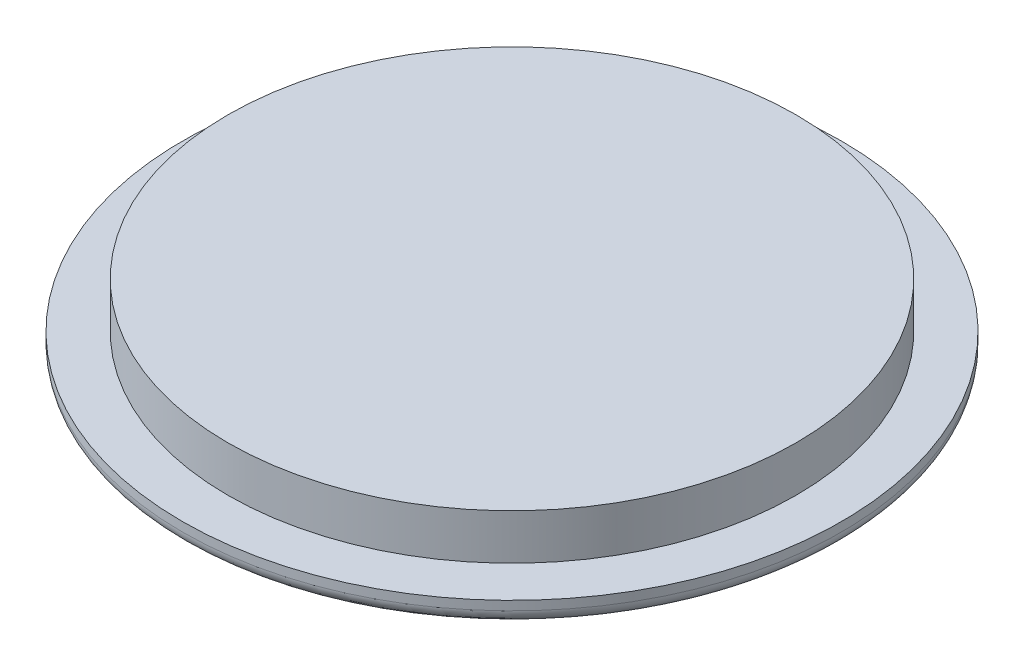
ISO-10303-21;
HEADER;
FILE_DESCRIPTION(('STEP AP214'),'2;1');
FILE_NAME('part.step','',(''),(''),'','','');
FILE_SCHEMA(('AUTOMOTIVE_DESIGN { 1 0 10303 214 1 1 1 1 }'));
ENDSEC;
DATA;
#1=APPLICATION_CONTEXT('core data for automotive mechanical design processes');
#2=APPLICATION_PROTOCOL_DEFINITION('international standard','automotive_design',2000,#1);
#3=PRODUCT_CONTEXT('',#1,'mechanical');
#4=PRODUCT('Part','Part','',(#3));
#5=PRODUCT_RELATED_PRODUCT_CATEGORY('part','',(#4));
#6=PRODUCT_DEFINITION_FORMATION('','',#4);
#7=PRODUCT_DEFINITION_CONTEXT('part definition',#1,'design');
#8=PRODUCT_DEFINITION('design','',#6,#7);
#9=PRODUCT_DEFINITION_SHAPE('','',#8);
#10=(LENGTH_UNIT() NAMED_UNIT(*) SI_UNIT(.MILLI.,.METRE.));
#11=(NAMED_UNIT(*) PLANE_ANGLE_UNIT() SI_UNIT($,.RADIAN.));
#12=(NAMED_UNIT(*) SI_UNIT($,.STERADIAN.) SOLID_ANGLE_UNIT());
#13=UNCERTAINTY_MEASURE_WITH_UNIT(LENGTH_MEASURE(1.E-05),#10,'distance_accuracy_value','');
#14=(GEOMETRIC_REPRESENTATION_CONTEXT(3) GLOBAL_UNCERTAINTY_ASSIGNED_CONTEXT((#13)) GLOBAL_UNIT_ASSIGNED_CONTEXT((#10,
#11,#12)) REPRESENTATION_CONTEXT('',''));
#15=CARTESIAN_POINT('',(0.,0.,0.));
#16=DIRECTION('',(0.,0.,1.));
#17=DIRECTION('',(1.,0.,0.));
#18=AXIS2_PLACEMENT_3D('',#15,#16,#17);
#19=CARTESIAN_POINT('',(0.,0.,0.));
#20=DIRECTION('',(0.,-1.,0.));
#21=DIRECTION('',(0.,0.,-1.));
#22=AXIS2_PLACEMENT_3D('',#19,#20,#21);
#23=PLANE('',#22);
#24=CARTESIAN_POINT('',(0.,0.,0.));
#25=DIRECTION('',(0.,-1.,0.));
#26=DIRECTION('',(0.,0.,-1.));
#27=AXIS2_PLACEMENT_3D('',#24,#25,#26);
#28=CIRCLE('',#27,69.5);
#29=CARTESIAN_POINT('',(0.,0.,-69.5));
#30=VERTEX_POINT('',#29);
#31=EDGE_CURVE('E10',#30,#30,#28,.T.);
#32=ORIENTED_EDGE('',*,*,#31,.T.);
#33=EDGE_LOOP('',(#32));
#34=FACE_BOUND('',#33,.T.);
#35=ADVANCED_FACE('F29',(#34),#23,.T.);
#36=CARTESIAN_POINT('',(0.,55.,0.));
#37=DIRECTION('',(0.,1.,0.));
#38=DIRECTION('',(0.,0.,1.));
#39=AXIS2_PLACEMENT_3D('',#36,#37,#38);
#40=CYLINDRICAL_SURFACE('',#39,72.5);
#41=CARTESIAN_POINT('',(0.,3.,0.));
#42=DIRECTION('',(0.,-1.,0.));
#43=DIRECTION('',(0.,0.,-1.));
#44=AXIS2_PLACEMENT_3D('',#41,#42,#43);
#45=CIRCLE('',#44,72.5);
#46=CARTESIAN_POINT('',(0.,3.,-72.5));
#47=VERTEX_POINT('',#46);
#48=EDGE_CURVE('E36',#47,#47,#45,.F.);
#49=ORIENTED_EDGE('',*,*,#48,.T.);
#50=EDGE_LOOP('',(#49));
#51=FACE_BOUND('',#50,.T.);
#52=CARTESIAN_POINT('',(0.,4.99999999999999,0.));
#53=DIRECTION('',(0.,1.,0.));
#54=DIRECTION('',(0.,0.,1.));
#55=AXIS2_PLACEMENT_3D('',#52,#53,#54);
#56=CIRCLE('',#55,72.5);
#57=CARTESIAN_POINT('',(0.,4.99999999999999,72.5));
#58=VERTEX_POINT('',#57);
#59=EDGE_CURVE('E40',#58,#58,#56,.T.);
#60=ORIENTED_EDGE('',*,*,#59,.F.);
#61=EDGE_LOOP('',(#60));
#62=FACE_BOUND('',#61,.T.);
#63=ADVANCED_FACE('F65',(#51,#62),#40,.T.);
#64=CARTESIAN_POINT('',(-72.5,4.99999999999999,0.));
#65=DIRECTION('',(0.,1.,0.));
#66=DIRECTION('',(0.,0.,1.));
#67=AXIS2_PLACEMENT_3D('',#64,#65,#66);
#68=PLANE('',#67);
#69=ORIENTED_EDGE('',*,*,#59,.T.);
#70=EDGE_LOOP('',(#69));
#71=FACE_BOUND('',#70,.T.);
#72=CARTESIAN_POINT('',(0.,4.99999999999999,0.));
#73=DIRECTION('',(0.,1.,0.));
#74=DIRECTION('',(0.,0.,1.));
#75=AXIS2_PLACEMENT_3D('',#72,#73,#74);
#76=CIRCLE('',#75,62.5);
#77=CARTESIAN_POINT('',(0.,4.99999999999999,62.5));
#78=VERTEX_POINT('',#77);
#79=EDGE_CURVE('E44',#78,#78,#76,.T.);
#80=ORIENTED_EDGE('',*,*,#79,.F.);
#81=EDGE_LOOP('',(#80));
#82=FACE_BOUND('',#81,.T.);
#83=ADVANCED_FACE('F57',(#71,#82),#68,.T.);
#84=CARTESIAN_POINT('',(0.,55.,0.));
#85=DIRECTION('',(0.,1.,0.));
#86=DIRECTION('',(0.,0.,1.));
#87=AXIS2_PLACEMENT_3D('',#84,#85,#86);
#88=CYLINDRICAL_SURFACE('',#87,62.5);
#89=ORIENTED_EDGE('',*,*,#79,.T.);
#90=EDGE_LOOP('',(#89));
#91=FACE_BOUND('',#90,.T.);
#92=CARTESIAN_POINT('',(0.,15.,0.));
#93=DIRECTION('',(0.,1.,0.));
#94=DIRECTION('',(0.,0.,1.));
#95=AXIS2_PLACEMENT_3D('',#92,#93,#94);
#96=CIRCLE('',#95,62.5);
#97=CARTESIAN_POINT('',(0.,15.,62.5));
#98=VERTEX_POINT('',#97);
#99=EDGE_CURVE('E49',#98,#98,#96,.T.);
#100=ORIENTED_EDGE('',*,*,#99,.F.);
#101=EDGE_LOOP('',(#100));
#102=FACE_BOUND('',#101,.T.);
#103=ADVANCED_FACE('F55',(#91,#102),#88,.T.);
#104=CARTESIAN_POINT('',(-62.5,15.,0.));
#105=DIRECTION('',(0.,1.,0.));
#106=DIRECTION('',(0.,0.,1.));
#107=AXIS2_PLACEMENT_3D('',#104,#105,#106);
#108=PLANE('',#107);
#109=ORIENTED_EDGE('',*,*,#99,.T.);
#110=EDGE_LOOP('',(#109));
#111=FACE_BOUND('',#110,.T.);
#112=ADVANCED_FACE('F53',(#111),#108,.T.);
#113=CARTESIAN_POINT('',(0.,3.,0.));
#114=DIRECTION('',(0.,-1.,0.));
#115=DIRECTION('',(0.,0.,-1.));
#116=AXIS2_PLACEMENT_3D('',#113,#114,#115);
#117=TOROIDAL_SURFACE('',#116,69.5,3.);
#118=ORIENTED_EDGE('',*,*,#31,.F.);
#119=EDGE_LOOP('',(#118));
#120=FACE_BOUND('',#119,.T.);
#121=ORIENTED_EDGE('',*,*,#48,.F.);
#122=EDGE_LOOP('',(#121));
#123=FACE_BOUND('',#122,.T.);
#124=ADVANCED_FACE('F31',(#120,#123),#117,.T.);
#125=CLOSED_SHELL('',(#35,#63,#83,#103,#112,#124));
#126=MANIFOLD_SOLID_BREP('B2',#125);
#127=ADVANCED_BREP_SHAPE_REPRESENTATION('',(#18,#126),#14);
#128=SHAPE_DEFINITION_REPRESENTATION(#9,#127);
ENDSEC;
END-ISO-10303-21;
